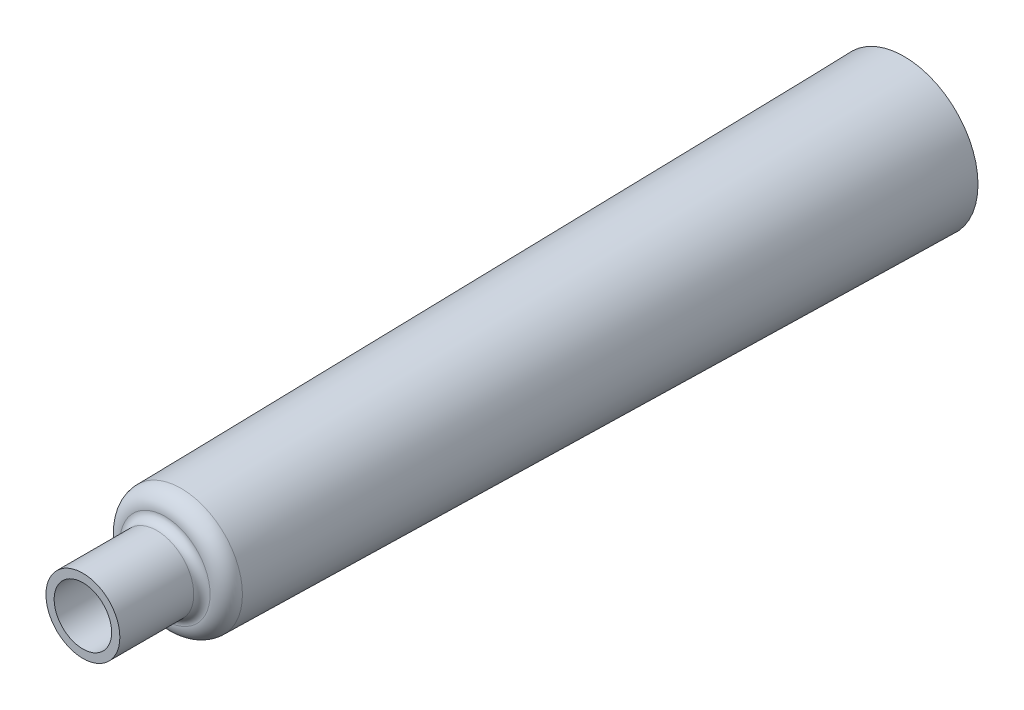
from build123d import *

# Parameters (mm, degrees)
SKETCH1_R           = 9
BASE_EXTRUDE_DEPTH  = 90
BASE_EXTRUDE_TAPER  = 1
SKETCH2_R           = 4.5
BOSS_EXTRUDE1_DEPTH = 10
FILLET1_R           = 2
FILLET2_R           = 1
SHELL1_T            = -1


with BuildPart() as part:
    # Sketch1 → Base-Extrude (new body)
    with BuildSketch(Plane.XY):
        Circle(SKETCH1_R)
    extrude(amount=BASE_EXTRUDE_DEPTH, taper=BASE_EXTRUDE_TAPER)

    # Sketch2 → Boss-Extrude1 (add)
    with BuildSketch(Plane.XY.offset(90)):
        Circle(SKETCH2_R)
    extrude(amount=BOSS_EXTRUDE1_DEPTH)

    # Fillet1
    fillet1_edges = [part.edges().sort_by_distance(p)[0] for p in [
        (-7.429044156, 0, 90),
    ]]
    fillet(fillet1_edges, radius=FILLET1_R)

    # Fillet2
    fillet2_edges = [part.edges().sort_by_distance(p)[0] for p in [
        (-4.5, 0, 90),
    ]]
    fillet(fillet2_edges, radius=FILLET2_R)

    # Shell1
    shell1_openings = [part.faces().sort_by_distance(p)[0] for p in [
        (0, 0, 100),
    ]]
    offset(amount=SHELL1_T, openings=shell1_openings, kind=Kind.INTERSECTION)


solid = part.part
